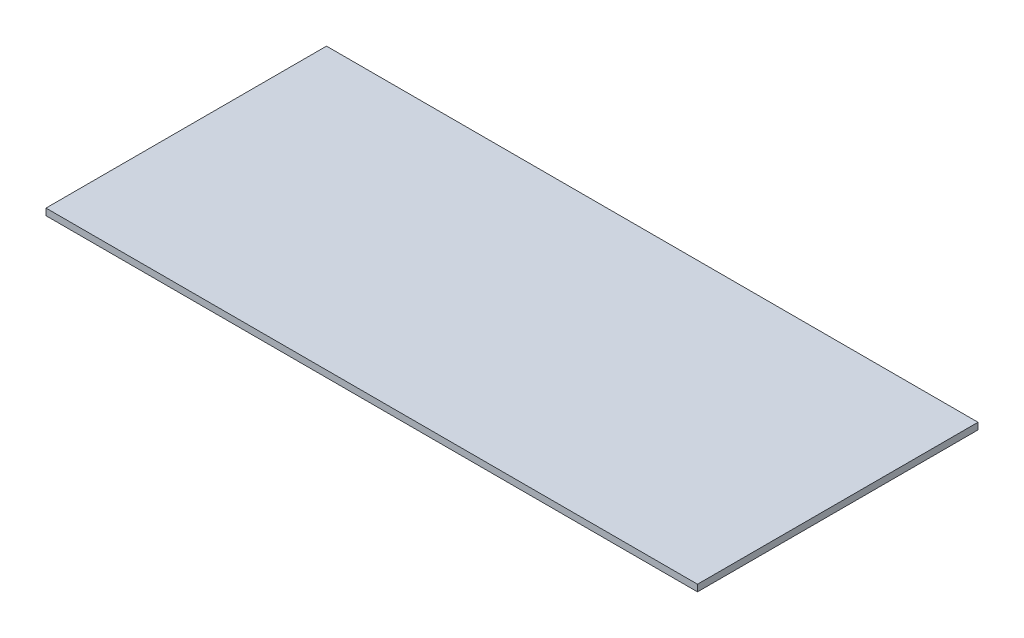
ISO-10303-21;
HEADER;
FILE_DESCRIPTION(('STEP AP214'),'2;1');
FILE_NAME('part.step','',(''),(''),'','','');
FILE_SCHEMA(('AUTOMOTIVE_DESIGN { 1 0 10303 214 1 1 1 1 }'));
ENDSEC;
DATA;
#1=APPLICATION_CONTEXT('core data for automotive mechanical design processes');
#2=APPLICATION_PROTOCOL_DEFINITION('international standard','automotive_design',2000,#1);
#3=PRODUCT_CONTEXT('',#1,'mechanical');
#4=PRODUCT('Part','Part','',(#3));
#5=PRODUCT_RELATED_PRODUCT_CATEGORY('part','',(#4));
#6=PRODUCT_DEFINITION_FORMATION('','',#4);
#7=PRODUCT_DEFINITION_CONTEXT('part definition',#1,'design');
#8=PRODUCT_DEFINITION('design','',#6,#7);
#9=PRODUCT_DEFINITION_SHAPE('','',#8);
#10=(LENGTH_UNIT() NAMED_UNIT(*) SI_UNIT(.MILLI.,.METRE.));
#11=(NAMED_UNIT(*) PLANE_ANGLE_UNIT() SI_UNIT($,.RADIAN.));
#12=(NAMED_UNIT(*) SI_UNIT($,.STERADIAN.) SOLID_ANGLE_UNIT());
#13=UNCERTAINTY_MEASURE_WITH_UNIT(LENGTH_MEASURE(1.E-05),#10,'distance_accuracy_value','');
#14=(GEOMETRIC_REPRESENTATION_CONTEXT(3) GLOBAL_UNCERTAINTY_ASSIGNED_CONTEXT((#13)) GLOBAL_UNIT_ASSIGNED_CONTEXT((#10,
#11,#12)) REPRESENTATION_CONTEXT('',''));
#15=CARTESIAN_POINT('',(0.,0.,0.));
#16=DIRECTION('',(0.,0.,1.));
#17=DIRECTION('',(1.,0.,0.));
#18=AXIS2_PLACEMENT_3D('',#15,#16,#17);
#19=CARTESIAN_POINT('',(0.,0.7366,31.));
#20=DIRECTION('',(0.,-1.,0.));
#21=DIRECTION('',(0.,0.,-1.));
#22=AXIS2_PLACEMENT_3D('',#19,#20,#21);
#23=PLANE('',#22);
#24=DIRECTION('',(1.,0.,0.));
#25=VECTOR('',#24,1.);
#26=CARTESIAN_POINT('',(0.,0.7366,0.));
#27=LINE('',#26,#25);
#28=CARTESIAN_POINT('',(72.0006693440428,0.7366,0.));
#29=VERTEX_POINT('',#28);
#30=CARTESIAN_POINT('',(0.,0.7366,0.));
#31=VERTEX_POINT('',#30);
#32=EDGE_CURVE('E97',#29,#31,#27,.F.);
#33=ORIENTED_EDGE('',*,*,#32,.T.);
#34=DIRECTION('',(0.,0.,-1.));
#35=VECTOR('',#34,1.);
#36=CARTESIAN_POINT('',(0.,0.7366,31.));
#37=LINE('',#36,#35);
#38=CARTESIAN_POINT('',(0.,0.7366,31.));
#39=VERTEX_POINT('',#38);
#40=EDGE_CURVE('E11',#39,#31,#37,.T.);
#41=ORIENTED_EDGE('',*,*,#40,.F.);
#42=DIRECTION('',(1.,0.,0.));
#43=VECTOR('',#42,1.);
#44=CARTESIAN_POINT('',(0.,0.7366,31.));
#45=LINE('',#44,#43);
#46=CARTESIAN_POINT('',(72.0006693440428,0.7366,31.));
#47=VERTEX_POINT('',#46);
#48=EDGE_CURVE('E74',#47,#39,#45,.F.);
#49=ORIENTED_EDGE('',*,*,#48,.F.);
#50=DIRECTION('',(0.,0.,-1.));
#51=VECTOR('',#50,1.);
#52=CARTESIAN_POINT('',(72.0006693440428,0.7366,31.));
#53=LINE('',#52,#51);
#54=EDGE_CURVE('E50',#47,#29,#53,.T.);
#55=ORIENTED_EDGE('',*,*,#54,.T.);
#56=EDGE_LOOP('',(#33,#41,#49,#55));
#57=FACE_BOUND('',#56,.T.);
#58=ADVANCED_FACE('F34',(#57),#23,.F.);
#59=CARTESIAN_POINT('',(0.,0.,31.));
#60=DIRECTION('',(-1.,0.,0.));
#61=DIRECTION('',(0.,0.,1.));
#62=AXIS2_PLACEMENT_3D('',#59,#60,#61);
#63=PLANE('',#62);
#64=DIRECTION('',(0.,1.,0.));
#65=VECTOR('',#64,1.);
#66=CARTESIAN_POINT('',(0.,0.,0.));
#67=LINE('',#66,#65);
#68=CARTESIAN_POINT('',(0.,0.,0.));
#69=VERTEX_POINT('',#68);
#70=EDGE_CURVE('E83',#69,#31,#67,.T.);
#71=ORIENTED_EDGE('',*,*,#70,.F.);
#72=DIRECTION('',(0.,0.,-1.));
#73=VECTOR('',#72,1.);
#74=CARTESIAN_POINT('',(0.,0.,31.));
#75=LINE('',#74,#73);
#76=CARTESIAN_POINT('',(0.,0.,31.));
#77=VERTEX_POINT('',#76);
#78=EDGE_CURVE('E42',#77,#69,#75,.T.);
#79=ORIENTED_EDGE('',*,*,#78,.F.);
#80=DIRECTION('',(0.,1.,0.));
#81=VECTOR('',#80,1.);
#82=CARTESIAN_POINT('',(0.,0.,31.));
#83=LINE('',#82,#81);
#84=EDGE_CURVE('E81',#77,#39,#83,.T.);
#85=ORIENTED_EDGE('',*,*,#84,.T.);
#86=ORIENTED_EDGE('',*,*,#40,.T.);
#87=EDGE_LOOP('',(#71,#79,#85,#86));
#88=FACE_BOUND('',#87,.T.);
#89=ADVANCED_FACE('F80',(#88),#63,.T.);
#90=CARTESIAN_POINT('',(0.,0.,31.));
#91=DIRECTION('',(0.,-1.,0.));
#92=DIRECTION('',(0.,0.,-1.));
#93=AXIS2_PLACEMENT_3D('',#90,#91,#92);
#94=PLANE('',#93);
#95=DIRECTION('',(-1.,0.,0.));
#96=VECTOR('',#95,1.);
#97=CARTESIAN_POINT('',(0.,0.,0.));
#98=LINE('',#97,#96);
#99=CARTESIAN_POINT('',(72.0006693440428,0.,0.));
#100=VERTEX_POINT('',#99);
#101=EDGE_CURVE('E100',#100,#69,#98,.T.);
#102=ORIENTED_EDGE('',*,*,#101,.F.);
#103=DIRECTION('',(0.,0.,-1.));
#104=VECTOR('',#103,1.);
#105=CARTESIAN_POINT('',(72.0006693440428,0.,31.));
#106=LINE('',#105,#104);
#107=CARTESIAN_POINT('',(72.0006693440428,0.,31.));
#108=VERTEX_POINT('',#107);
#109=EDGE_CURVE('E63',#108,#100,#106,.T.);
#110=ORIENTED_EDGE('',*,*,#109,.F.);
#111=DIRECTION('',(-1.,0.,0.));
#112=VECTOR('',#111,1.);
#113=CARTESIAN_POINT('',(0.,0.,31.));
#114=LINE('',#113,#112);
#115=EDGE_CURVE('E89',#108,#77,#114,.T.);
#116=ORIENTED_EDGE('',*,*,#115,.T.);
#117=ORIENTED_EDGE('',*,*,#78,.T.);
#118=EDGE_LOOP('',(#102,#110,#116,#117));
#119=FACE_BOUND('',#118,.T.);
#120=ADVANCED_FACE('F91',(#119),#94,.T.);
#121=CARTESIAN_POINT('',(72.0006693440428,0.7366,31.));
#122=DIRECTION('',(1.,0.,0.));
#123=DIRECTION('',(0.,0.,-1.));
#124=AXIS2_PLACEMENT_3D('',#121,#122,#123);
#125=PLANE('',#124);
#126=DIRECTION('',(0.,-1.,0.));
#127=VECTOR('',#126,1.);
#128=CARTESIAN_POINT('',(72.0006693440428,0.7366,0.));
#129=LINE('',#128,#127);
#130=EDGE_CURVE('E102',#29,#100,#129,.T.);
#131=ORIENTED_EDGE('',*,*,#130,.F.);
#132=ORIENTED_EDGE('',*,*,#54,.F.);
#133=DIRECTION('',(0.,-1.,0.));
#134=VECTOR('',#133,1.);
#135=CARTESIAN_POINT('',(72.0006693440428,0.7366,31.));
#136=LINE('',#135,#134);
#137=EDGE_CURVE('E92',#47,#108,#136,.T.);
#138=ORIENTED_EDGE('',*,*,#137,.T.);
#139=ORIENTED_EDGE('',*,*,#109,.T.);
#140=EDGE_LOOP('',(#131,#132,#138,#139));
#141=FACE_BOUND('',#140,.T.);
#142=ADVANCED_FACE('F108',(#141),#125,.T.);
#143=CARTESIAN_POINT('',(0.,0.7366,31.));
#144=DIRECTION('',(0.,0.,1.));
#145=DIRECTION('',(1.,0.,0.));
#146=AXIS2_PLACEMENT_3D('',#143,#144,#145);
#147=PLANE('',#146);
#148=ORIENTED_EDGE('',*,*,#48,.T.);
#149=ORIENTED_EDGE('',*,*,#84,.F.);
#150=ORIENTED_EDGE('',*,*,#115,.F.);
#151=ORIENTED_EDGE('',*,*,#137,.F.);
#152=EDGE_LOOP('',(#148,#149,#150,#151));
#153=FACE_BOUND('',#152,.T.);
#154=ADVANCED_FACE('F88',(#153),#147,.T.);
#155=CARTESIAN_POINT('',(0.,0.7366,0.));
#156=DIRECTION('',(0.,0.,1.));
#157=DIRECTION('',(1.,0.,0.));
#158=AXIS2_PLACEMENT_3D('',#155,#156,#157);
#159=PLANE('',#158);
#160=ORIENTED_EDGE('',*,*,#32,.F.);
#161=ORIENTED_EDGE('',*,*,#130,.T.);
#162=ORIENTED_EDGE('',*,*,#101,.T.);
#163=ORIENTED_EDGE('',*,*,#70,.T.);
#164=EDGE_LOOP('',(#160,#161,#162,#163));
#165=FACE_BOUND('',#164,.T.);
#166=ADVANCED_FACE('F107',(#165),#159,.F.);
#167=CLOSED_SHELL('',(#58,#89,#120,#142,#154,#166));
#168=MANIFOLD_SOLID_BREP('B2',#167);
#169=ADVANCED_BREP_SHAPE_REPRESENTATION('',(#18,#168),#14);
#170=SHAPE_DEFINITION_REPRESENTATION(#9,#169);
ENDSEC;
END-ISO-10303-21;
